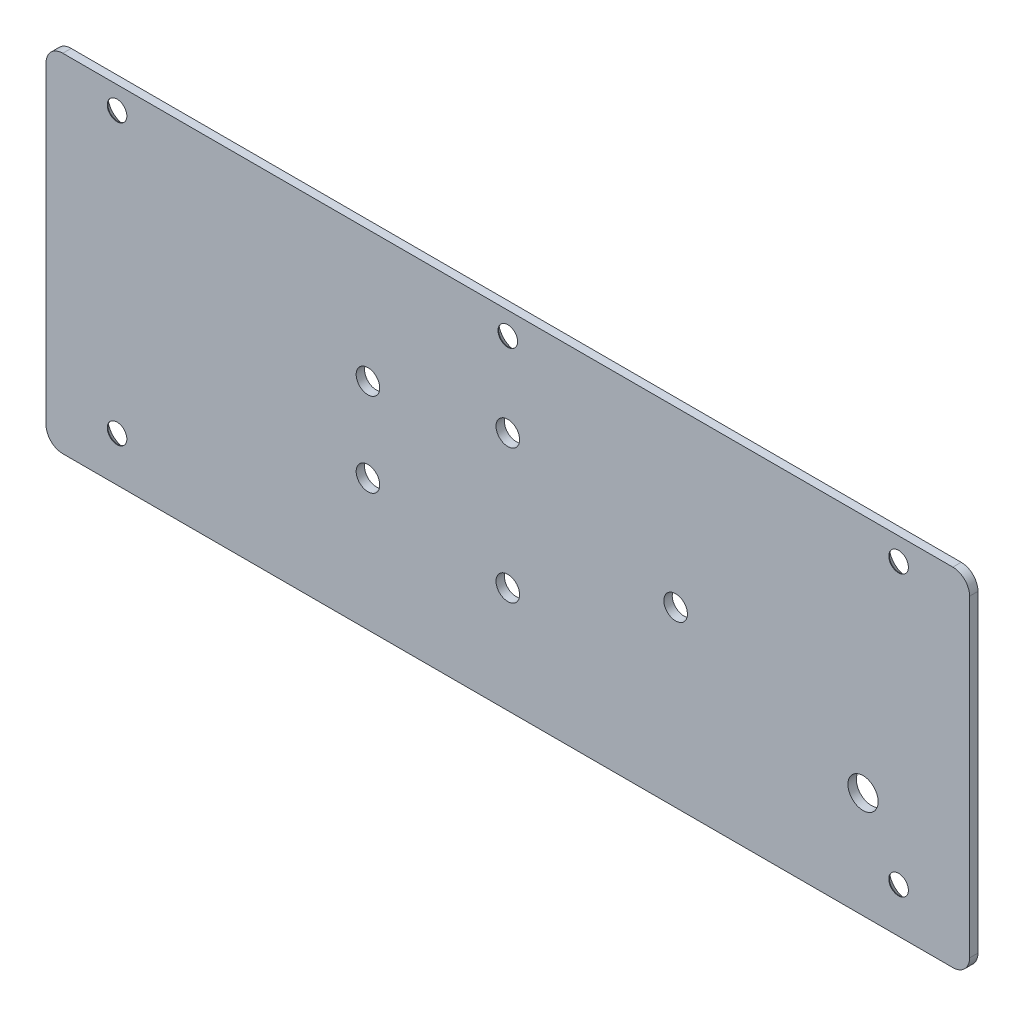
ISO-10303-21;
HEADER;
FILE_DESCRIPTION(('STEP AP214'),'2;1');
FILE_NAME('part.step','',(''),(''),'','','');
FILE_SCHEMA(('AUTOMOTIVE_DESIGN { 1 0 10303 214 1 1 1 1 }'));
ENDSEC;
DATA;
#1=APPLICATION_CONTEXT('core data for automotive mechanical design processes');
#2=APPLICATION_PROTOCOL_DEFINITION('international standard','automotive_design',2000,#1);
#3=PRODUCT_CONTEXT('',#1,'mechanical');
#4=PRODUCT('Part','Part','',(#3));
#5=PRODUCT_RELATED_PRODUCT_CATEGORY('part','',(#4));
#6=PRODUCT_DEFINITION_FORMATION('','',#4);
#7=PRODUCT_DEFINITION_CONTEXT('part definition',#1,'design');
#8=PRODUCT_DEFINITION('design','',#6,#7);
#9=PRODUCT_DEFINITION_SHAPE('','',#8);
#10=(LENGTH_UNIT() NAMED_UNIT(*) SI_UNIT(.MILLI.,.METRE.));
#11=(NAMED_UNIT(*) PLANE_ANGLE_UNIT() SI_UNIT($,.RADIAN.));
#12=(NAMED_UNIT(*) SI_UNIT($,.STERADIAN.) SOLID_ANGLE_UNIT());
#13=UNCERTAINTY_MEASURE_WITH_UNIT(LENGTH_MEASURE(1.E-05),#10,'distance_accuracy_value','');
#14=(GEOMETRIC_REPRESENTATION_CONTEXT(3) GLOBAL_UNCERTAINTY_ASSIGNED_CONTEXT((#13)) GLOBAL_UNIT_ASSIGNED_CONTEXT((#10,
#11,#12)) REPRESENTATION_CONTEXT('',''));
#15=CARTESIAN_POINT('',(0.,0.,0.));
#16=DIRECTION('',(0.,0.,1.));
#17=DIRECTION('',(1.,0.,0.));
#18=AXIS2_PLACEMENT_3D('',#15,#16,#17);
#19=CARTESIAN_POINT('',(-165.1,0.,0.));
#20=DIRECTION('',(0.,0.,-1.));
#21=DIRECTION('',(0.,1.,0.));
#22=AXIS2_PLACEMENT_3D('',#19,#20,#21);
#23=PLANE('',#22);
#24=CARTESIAN_POINT('',(-82.55,58.,0.));
#25=DIRECTION('',(0.,0.,-1.));
#26=DIRECTION('',(0.,1.,0.));
#27=AXIS2_PLACEMENT_3D('',#24,#25,#26);
#28=CIRCLE('',#27,3.15000000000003);
#29=CARTESIAN_POINT('',(-85.7,58.,0.));
#30=VERTEX_POINT('',#29);
#31=EDGE_CURVE('E248',#30,#30,#28,.F.);
#32=ORIENTED_EDGE('',*,*,#31,.T.);
#33=EDGE_LOOP('',(#32));
#34=FACE_BOUND('',#33,.T.);
#35=CARTESIAN_POINT('',(-152.4,58.,0.));
#36=DIRECTION('',(0.,0.,-1.));
#37=DIRECTION('',(0.,1.,0.));
#38=AXIS2_PLACEMENT_3D('',#35,#36,#37);
#39=CIRCLE('',#38,3.14999999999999);
#40=CARTESIAN_POINT('',(-152.4,61.15,0.));
#41=VERTEX_POINT('',#40);
#42=EDGE_CURVE('E244',#41,#41,#39,.F.);
#43=ORIENTED_EDGE('',*,*,#42,.T.);
#44=EDGE_LOOP('',(#43));
#45=FACE_BOUND('',#44,.T.);
#46=CARTESIAN_POINT('',(-152.4,8.,0.));
#47=DIRECTION('',(0.,0.,-1.));
#48=DIRECTION('',(0.,1.,0.));
#49=AXIS2_PLACEMENT_3D('',#46,#47,#48);
#50=CIRCLE('',#49,3.14999999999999);
#51=CARTESIAN_POINT('',(-152.4,11.15,0.));
#52=VERTEX_POINT('',#51);
#53=EDGE_CURVE('E240',#52,#52,#50,.F.);
#54=ORIENTED_EDGE('',*,*,#53,.T.);
#55=EDGE_LOOP('',(#54));
#56=FACE_BOUND('',#55,.T.);
#57=CARTESIAN_POINT('',(-12.7,8.,0.));
#58=DIRECTION('',(0.,0.,-1.));
#59=DIRECTION('',(0.,1.,0.));
#60=AXIS2_PLACEMENT_3D('',#57,#58,#59);
#61=CIRCLE('',#60,3.15000000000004);
#62=CARTESIAN_POINT('',(-12.7,11.15,0.));
#63=VERTEX_POINT('',#62);
#64=EDGE_CURVE('E236',#63,#63,#61,.F.);
#65=ORIENTED_EDGE('',*,*,#64,.T.);
#66=EDGE_LOOP('',(#65));
#67=FACE_BOUND('',#66,.T.);
#68=CARTESIAN_POINT('',(-12.7,58.,0.));
#69=DIRECTION('',(0.,0.,-1.));
#70=DIRECTION('',(0.,1.,0.));
#71=AXIS2_PLACEMENT_3D('',#68,#69,#70);
#72=CIRCLE('',#71,3.15);
#73=CARTESIAN_POINT('',(-12.7,61.15,0.));
#74=VERTEX_POINT('',#73);
#75=EDGE_CURVE('E232',#74,#74,#72,.F.);
#76=ORIENTED_EDGE('',*,*,#75,.T.);
#77=EDGE_LOOP('',(#76));
#78=FACE_BOUND('',#77,.T.);
#79=DIRECTION('',(0.,1.,0.));
#80=VECTOR('',#79,1.);
#81=CARTESIAN_POINT('',(-165.1,0.,0.));
#82=LINE('',#81,#80);
#83=CARTESIAN_POINT('',(-165.1,3.,0.));
#84=VERTEX_POINT('',#83);
#85=CARTESIAN_POINT('',(-165.1,59.,0.));
#86=VERTEX_POINT('',#85);
#87=EDGE_CURVE('E133',#84,#86,#82,.T.);
#88=ORIENTED_EDGE('',*,*,#87,.T.);
#89=CARTESIAN_POINT('',(-162.1,59.,0.));
#90=DIRECTION('',(0.,0.,-1.));
#91=DIRECTION('',(0.,1.,0.));
#92=AXIS2_PLACEMENT_3D('',#89,#90,#91);
#93=CIRCLE('',#92,3.);
#94=CARTESIAN_POINT('',(-162.1,62.,0.));
#95=VERTEX_POINT('',#94);
#96=EDGE_CURVE('E140',#86,#95,#93,.T.);
#97=ORIENTED_EDGE('',*,*,#96,.T.);
#98=DIRECTION('',(1.,0.,0.));
#99=VECTOR('',#98,1.);
#100=CARTESIAN_POINT('',(-165.1,62.,0.));
#101=LINE('',#100,#99);
#102=CARTESIAN_POINT('',(-3.,62.,0.));
#103=VERTEX_POINT('',#102);
#104=EDGE_CURVE('E219',#95,#103,#101,.T.);
#105=ORIENTED_EDGE('',*,*,#104,.T.);
#106=CARTESIAN_POINT('',(-3.,59.,0.));
#107=DIRECTION('',(0.,0.,-1.));
#108=DIRECTION('',(0.,1.,0.));
#109=AXIS2_PLACEMENT_3D('',#106,#107,#108);
#110=CIRCLE('',#109,3.);
#111=CARTESIAN_POINT('',(0.,59.,0.));
#112=VERTEX_POINT('',#111);
#113=EDGE_CURVE('E162',#103,#112,#110,.T.);
#114=ORIENTED_EDGE('',*,*,#113,.T.);
#115=DIRECTION('',(0.,1.,0.));
#116=VECTOR('',#115,1.);
#117=CARTESIAN_POINT('',(0.,0.,0.));
#118=LINE('',#117,#116);
#119=CARTESIAN_POINT('',(0.,3.,0.));
#120=VERTEX_POINT('',#119);
#121=EDGE_CURVE('E206',#120,#112,#118,.T.);
#122=ORIENTED_EDGE('',*,*,#121,.F.);
#123=CARTESIAN_POINT('',(-3.,3.,0.));
#124=DIRECTION('',(0.,0.,-1.));
#125=DIRECTION('',(0.,1.,0.));
#126=AXIS2_PLACEMENT_3D('',#123,#124,#125);
#127=CIRCLE('',#126,3.);
#128=CARTESIAN_POINT('',(-3.,0.,0.));
#129=VERTEX_POINT('',#128);
#130=EDGE_CURVE('E141',#120,#129,#127,.T.);
#131=ORIENTED_EDGE('',*,*,#130,.T.);
#132=DIRECTION('',(1.,0.,0.));
#133=VECTOR('',#132,1.);
#134=CARTESIAN_POINT('',(-165.1,0.,0.));
#135=LINE('',#134,#133);
#136=CARTESIAN_POINT('',(-162.1,0.,0.));
#137=VERTEX_POINT('',#136);
#138=EDGE_CURVE('E135',#137,#129,#135,.T.);
#139=ORIENTED_EDGE('',*,*,#138,.F.);
#140=CARTESIAN_POINT('',(-162.1,3.,0.));
#141=DIRECTION('',(0.,0.,-1.));
#142=DIRECTION('',(0.,1.,0.));
#143=AXIS2_PLACEMENT_3D('',#140,#141,#142);
#144=CIRCLE('',#143,3.);
#145=EDGE_CURVE('E130',#137,#84,#144,.T.);
#146=ORIENTED_EDGE('',*,*,#145,.T.);
#147=EDGE_LOOP('',(#88,#97,#105,#114,#122,#131,#139,#146));
#148=FACE_BOUND('',#147,.T.);
#149=CARTESIAN_POINT('',(-107.55,38.5,0.));
#150=DIRECTION('',(0.,0.,-1.));
#151=DIRECTION('',(0.,1.,0.));
#152=AXIS2_PLACEMENT_3D('',#149,#150,#151);
#153=CIRCLE('',#152,2.1082);
#154=CARTESIAN_POINT('',(-107.55,40.6082,0.));
#155=VERTEX_POINT('',#154);
#156=EDGE_CURVE('E318',#155,#155,#153,.T.);
#157=ORIENTED_EDGE('',*,*,#156,.F.);
#158=EDGE_LOOP('',(#157));
#159=FACE_BOUND('',#158,.T.);
#160=CARTESIAN_POINT('',(-52.55,31.,0.));
#161=DIRECTION('',(0.,0.,-1.));
#162=DIRECTION('',(0.,1.,0.));
#163=AXIS2_PLACEMENT_3D('',#160,#161,#162);
#164=CIRCLE('',#163,2.1082);
#165=CARTESIAN_POINT('',(-52.55,33.1082,0.));
#166=VERTEX_POINT('',#165);
#167=EDGE_CURVE('E346',#166,#166,#164,.T.);
#168=ORIENTED_EDGE('',*,*,#167,.F.);
#169=EDGE_LOOP('',(#168));
#170=FACE_BOUND('',#169,.T.);
#171=CARTESIAN_POINT('',(-82.55,19.,0.));
#172=DIRECTION('',(0.,0.,-1.));
#173=DIRECTION('',(0.,1.,0.));
#174=AXIS2_PLACEMENT_3D('',#171,#172,#173);
#175=CIRCLE('',#174,2.1082);
#176=CARTESIAN_POINT('',(-82.55,21.1082,0.));
#177=VERTEX_POINT('',#176);
#178=EDGE_CURVE('E331',#177,#177,#175,.T.);
#179=ORIENTED_EDGE('',*,*,#178,.F.);
#180=EDGE_LOOP('',(#179));
#181=FACE_BOUND('',#180,.T.);
#182=CARTESIAN_POINT('',(-107.55,23.5,0.));
#183=DIRECTION('',(0.,0.,-1.));
#184=DIRECTION('',(0.,1.,0.));
#185=AXIS2_PLACEMENT_3D('',#182,#183,#184);
#186=CIRCLE('',#185,2.1082);
#187=CARTESIAN_POINT('',(-107.55,25.6082,0.));
#188=VERTEX_POINT('',#187);
#189=EDGE_CURVE('E330',#188,#188,#186,.T.);
#190=ORIENTED_EDGE('',*,*,#189,.F.);
#191=EDGE_LOOP('',(#190));
#192=FACE_BOUND('',#191,.T.);
#193=CARTESIAN_POINT('',(-82.55,43.,0.));
#194=DIRECTION('',(0.,0.,-1.));
#195=DIRECTION('',(0.,1.,0.));
#196=AXIS2_PLACEMENT_3D('',#193,#194,#195);
#197=CIRCLE('',#196,2.1082);
#198=CARTESIAN_POINT('',(-82.55,45.1082,0.));
#199=VERTEX_POINT('',#198);
#200=EDGE_CURVE('E322',#199,#199,#197,.T.);
#201=ORIENTED_EDGE('',*,*,#200,.F.);
#202=EDGE_LOOP('',(#201));
#203=FACE_BOUND('',#202,.T.);
#204=CARTESIAN_POINT('',(-19.05,19.,0.));
#205=DIRECTION('',(0.,0.,-1.));
#206=DIRECTION('',(0.,1.,0.));
#207=AXIS2_PLACEMENT_3D('',#204,#205,#206);
#208=CIRCLE('',#207,5.);
#209=CARTESIAN_POINT('',(-19.05,14.,0.));
#210=VERTEX_POINT('',#209);
#211=EDGE_CURVE('E382',#210,#210,#208,.T.);
#212=ORIENTED_EDGE('',*,*,#211,.F.);
#213=EDGE_LOOP('',(#212));
#214=FACE_BOUND('',#213,.T.);
#215=ADVANCED_FACE('F62',(#34,#45,#56,#67,#78,#148,#159,#170,#181,#192,#203,#214),#23,.T.);
#216=CARTESIAN_POINT('',(-165.1,0.,0.));
#217=DIRECTION('',(0.,1.,0.));
#218=DIRECTION('',(0.,0.,1.));
#219=AXIS2_PLACEMENT_3D('',#216,#217,#218);
#220=PLANE('',#219);
#221=DIRECTION('',(1.,0.,0.));
#222=VECTOR('',#221,1.);
#223=CARTESIAN_POINT('',(-165.1,0.,1.5));
#224=LINE('',#223,#222);
#225=CARTESIAN_POINT('',(-162.1,0.,1.5));
#226=VERTEX_POINT('',#225);
#227=CARTESIAN_POINT('',(-3.,0.,1.5));
#228=VERTEX_POINT('',#227);
#229=EDGE_CURVE('E227',#226,#228,#224,.T.);
#230=ORIENTED_EDGE('',*,*,#229,.F.);
#231=DIRECTION('',(0.,0.,1.));
#232=VECTOR('',#231,1.);
#233=CARTESIAN_POINT('',(-162.1,0.,0.));
#234=LINE('',#233,#232);
#235=EDGE_CURVE('E195',#226,#137,#234,.F.);
#236=ORIENTED_EDGE('',*,*,#235,.T.);
#237=ORIENTED_EDGE('',*,*,#138,.T.);
#238=DIRECTION('',(0.,0.,1.));
#239=VECTOR('',#238,1.);
#240=CARTESIAN_POINT('',(-3.,0.,0.));
#241=LINE('',#240,#239);
#242=EDGE_CURVE('E192',#129,#228,#241,.T.);
#243=ORIENTED_EDGE('',*,*,#242,.T.);
#244=EDGE_LOOP('',(#230,#236,#237,#243));
#245=FACE_BOUND('',#244,.T.);
#246=ADVANCED_FACE('F281',(#245),#220,.F.);
#247=CARTESIAN_POINT('',(-165.1,0.,1.5));
#248=DIRECTION('',(0.,0.,-1.));
#249=DIRECTION('',(0.,1.,0.));
#250=AXIS2_PLACEMENT_3D('',#247,#248,#249);
#251=PLANE('',#250);
#252=CARTESIAN_POINT('',(-19.05,19.,1.5));
#253=DIRECTION('',(0.,0.,-1.));
#254=DIRECTION('',(0.,1.,0.));
#255=AXIS2_PLACEMENT_3D('',#252,#253,#254);
#256=CIRCLE('',#255,2.7);
#257=CARTESIAN_POINT('',(-19.05,21.7,1.5));
#258=VERTEX_POINT('',#257);
#259=EDGE_CURVE('E367',#258,#258,#256,.F.);
#260=ORIENTED_EDGE('',*,*,#259,.F.);
#261=EDGE_LOOP('',(#260));
#262=FACE_BOUND('',#261,.T.);
#263=CARTESIAN_POINT('',(-152.4,8.,1.5));
#264=DIRECTION('',(0.,0.,1.));
#265=DIRECTION('',(1.,0.,0.));
#266=AXIS2_PLACEMENT_3D('',#263,#264,#265);
#267=CIRCLE('',#266,1.75000000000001);
#268=CARTESIAN_POINT('',(-150.65,8.,1.5));
#269=VERTEX_POINT('',#268);
#270=EDGE_CURVE('E362',#269,#269,#267,.T.);
#271=ORIENTED_EDGE('',*,*,#270,.F.);
#272=EDGE_LOOP('',(#271));
#273=FACE_BOUND('',#272,.T.);
#274=CARTESIAN_POINT('',(-12.7,8.,1.5));
#275=DIRECTION('',(0.,0.,1.));
#276=DIRECTION('',(1.,0.,0.));
#277=AXIS2_PLACEMENT_3D('',#274,#275,#276);
#278=CIRCLE('',#277,1.75);
#279=CARTESIAN_POINT('',(-10.95,8.,1.5));
#280=VERTEX_POINT('',#279);
#281=EDGE_CURVE('E366',#280,#280,#278,.T.);
#282=ORIENTED_EDGE('',*,*,#281,.F.);
#283=EDGE_LOOP('',(#282));
#284=FACE_BOUND('',#283,.T.);
#285=CARTESIAN_POINT('',(-12.7,58.,1.5));
#286=DIRECTION('',(0.,0.,1.));
#287=DIRECTION('',(1.,0.,0.));
#288=AXIS2_PLACEMENT_3D('',#285,#286,#287);
#289=CIRCLE('',#288,1.75);
#290=CARTESIAN_POINT('',(-10.95,58.,1.5));
#291=VERTEX_POINT('',#290);
#292=EDGE_CURVE('E371',#291,#291,#289,.T.);
#293=ORIENTED_EDGE('',*,*,#292,.F.);
#294=EDGE_LOOP('',(#293));
#295=FACE_BOUND('',#294,.T.);
#296=CARTESIAN_POINT('',(-152.4,58.,1.5));
#297=DIRECTION('',(0.,0.,1.));
#298=DIRECTION('',(1.,0.,0.));
#299=AXIS2_PLACEMENT_3D('',#296,#297,#298);
#300=CIRCLE('',#299,1.75000000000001);
#301=CARTESIAN_POINT('',(-150.65,58.,1.5));
#302=VERTEX_POINT('',#301);
#303=EDGE_CURVE('E361',#302,#302,#300,.T.);
#304=ORIENTED_EDGE('',*,*,#303,.F.);
#305=EDGE_LOOP('',(#304));
#306=FACE_BOUND('',#305,.T.);
#307=CARTESIAN_POINT('',(-82.55,58.,1.5));
#308=DIRECTION('',(0.,0.,1.));
#309=DIRECTION('',(1.,0.,0.));
#310=AXIS2_PLACEMENT_3D('',#307,#308,#309);
#311=CIRCLE('',#310,1.75);
#312=CARTESIAN_POINT('',(-80.8,58.,1.5));
#313=VERTEX_POINT('',#312);
#314=EDGE_CURVE('E347',#313,#313,#311,.T.);
#315=ORIENTED_EDGE('',*,*,#314,.F.);
#316=EDGE_LOOP('',(#315));
#317=FACE_BOUND('',#316,.T.);
#318=CARTESIAN_POINT('',(-82.55,43.,1.5));
#319=DIRECTION('',(0.,0.,-1.));
#320=DIRECTION('',(0.,1.,0.));
#321=AXIS2_PLACEMENT_3D('',#318,#319,#320);
#322=CIRCLE('',#321,2.1082);
#323=CARTESIAN_POINT('',(-82.55,45.1082,1.5));
#324=VERTEX_POINT('',#323);
#325=EDGE_CURVE('E335',#324,#324,#322,.T.);
#326=ORIENTED_EDGE('',*,*,#325,.T.);
#327=EDGE_LOOP('',(#326));
#328=FACE_BOUND('',#327,.T.);
#329=CARTESIAN_POINT('',(-107.55,23.5,1.5));
#330=DIRECTION('',(0.,0.,-1.));
#331=DIRECTION('',(0.,1.,0.));
#332=AXIS2_PLACEMENT_3D('',#329,#330,#331);
#333=CIRCLE('',#332,2.1082);
#334=CARTESIAN_POINT('',(-107.55,25.6082,1.5));
#335=VERTEX_POINT('',#334);
#336=EDGE_CURVE('E326',#335,#335,#333,.T.);
#337=ORIENTED_EDGE('',*,*,#336,.T.);
#338=EDGE_LOOP('',(#337));
#339=FACE_BOUND('',#338,.T.);
#340=CARTESIAN_POINT('',(-82.55,19.,1.5));
#341=DIRECTION('',(0.,0.,-1.));
#342=DIRECTION('',(0.,1.,0.));
#343=AXIS2_PLACEMENT_3D('',#340,#341,#342);
#344=CIRCLE('',#343,2.1082);
#345=CARTESIAN_POINT('',(-82.55,21.1082,1.5));
#346=VERTEX_POINT('',#345);
#347=EDGE_CURVE('E351',#346,#346,#344,.T.);
#348=ORIENTED_EDGE('',*,*,#347,.T.);
#349=EDGE_LOOP('',(#348));
#350=FACE_BOUND('',#349,.T.);
#351=CARTESIAN_POINT('',(-52.55,31.,1.5));
#352=DIRECTION('',(0.,0.,-1.));
#353=DIRECTION('',(0.,1.,0.));
#354=AXIS2_PLACEMENT_3D('',#351,#352,#353);
#355=CIRCLE('',#354,2.1082);
#356=CARTESIAN_POINT('',(-52.55,33.1082,1.5));
#357=VERTEX_POINT('',#356);
#358=EDGE_CURVE('E342',#357,#357,#355,.T.);
#359=ORIENTED_EDGE('',*,*,#358,.T.);
#360=EDGE_LOOP('',(#359));
#361=FACE_BOUND('',#360,.T.);
#362=CARTESIAN_POINT('',(-107.55,38.5,1.5));
#363=DIRECTION('',(0.,0.,-1.));
#364=DIRECTION('',(0.,1.,0.));
#365=AXIS2_PLACEMENT_3D('',#362,#363,#364);
#366=CIRCLE('',#365,2.1082);
#367=CARTESIAN_POINT('',(-107.55,40.6082,1.5));
#368=VERTEX_POINT('',#367);
#369=EDGE_CURVE('E316',#368,#368,#366,.T.);
#370=ORIENTED_EDGE('',*,*,#369,.T.);
#371=EDGE_LOOP('',(#370));
#372=FACE_BOUND('',#371,.T.);
#373=DIRECTION('',(1.,0.,0.));
#374=VECTOR('',#373,1.);
#375=CARTESIAN_POINT('',(-165.1,62.,1.5));
#376=LINE('',#375,#374);
#377=CARTESIAN_POINT('',(-162.1,62.,1.5));
#378=VERTEX_POINT('',#377);
#379=CARTESIAN_POINT('',(-3.,62.,1.5));
#380=VERTEX_POINT('',#379);
#381=EDGE_CURVE('E221',#378,#380,#376,.T.);
#382=ORIENTED_EDGE('',*,*,#381,.F.);
#383=CARTESIAN_POINT('',(-162.1,59.,1.5));
#384=DIRECTION('',(0.,0.,-1.));
#385=DIRECTION('',(0.,1.,0.));
#386=AXIS2_PLACEMENT_3D('',#383,#384,#385);
#387=CIRCLE('',#386,3.);
#388=CARTESIAN_POINT('',(-165.1,59.,1.5));
#389=VERTEX_POINT('',#388);
#390=EDGE_CURVE('E189',#378,#389,#387,.F.);
#391=ORIENTED_EDGE('',*,*,#390,.T.);
#392=DIRECTION('',(0.,1.,0.));
#393=VECTOR('',#392,1.);
#394=CARTESIAN_POINT('',(-165.1,0.,1.5));
#395=LINE('',#394,#393);
#396=CARTESIAN_POINT('',(-165.1,3.,1.5));
#397=VERTEX_POINT('',#396);
#398=EDGE_CURVE('E152',#397,#389,#395,.T.);
#399=ORIENTED_EDGE('',*,*,#398,.F.);
#400=CARTESIAN_POINT('',(-162.1,3.,1.5));
#401=DIRECTION('',(0.,0.,-1.));
#402=DIRECTION('',(0.,1.,0.));
#403=AXIS2_PLACEMENT_3D('',#400,#401,#402);
#404=CIRCLE('',#403,3.);
#405=EDGE_CURVE('E86',#397,#226,#404,.F.);
#406=ORIENTED_EDGE('',*,*,#405,.T.);
#407=ORIENTED_EDGE('',*,*,#229,.T.);
#408=CARTESIAN_POINT('',(-3.,3.,1.5));
#409=DIRECTION('',(0.,0.,-1.));
#410=DIRECTION('',(0.,1.,0.));
#411=AXIS2_PLACEMENT_3D('',#408,#409,#410);
#412=CIRCLE('',#411,3.);
#413=CARTESIAN_POINT('',(0.,3.,1.5));
#414=VERTEX_POINT('',#413);
#415=EDGE_CURVE('E78',#228,#414,#412,.F.);
#416=ORIENTED_EDGE('',*,*,#415,.T.);
#417=DIRECTION('',(0.,1.,0.));
#418=VECTOR('',#417,1.);
#419=CARTESIAN_POINT('',(0.,0.,1.5));
#420=LINE('',#419,#418);
#421=CARTESIAN_POINT('',(0.,59.,1.5));
#422=VERTEX_POINT('',#421);
#423=EDGE_CURVE('E153',#414,#422,#420,.T.);
#424=ORIENTED_EDGE('',*,*,#423,.T.);
#425=CARTESIAN_POINT('',(-3.,59.,1.5));
#426=DIRECTION('',(0.,0.,-1.));
#427=DIRECTION('',(0.,1.,0.));
#428=AXIS2_PLACEMENT_3D('',#425,#426,#427);
#429=CIRCLE('',#428,3.);
#430=EDGE_CURVE('E182',#422,#380,#429,.F.);
#431=ORIENTED_EDGE('',*,*,#430,.T.);
#432=EDGE_LOOP('',(#382,#391,#399,#406,#407,#416,#424,#431));
#433=FACE_BOUND('',#432,.T.);
#434=ADVANCED_FACE('F210',(#262,#273,#284,#295,#306,#317,#328,#339,#350,#361,#372,#433),#251,.F.);
#435=CARTESIAN_POINT('',(-165.1,62.,1.5));
#436=DIRECTION('',(0.,-1.,0.));
#437=DIRECTION('',(0.,0.,-1.));
#438=AXIS2_PLACEMENT_3D('',#435,#436,#437);
#439=PLANE('',#438);
#440=ORIENTED_EDGE('',*,*,#104,.F.);
#441=DIRECTION('',(0.,0.,-1.));
#442=VECTOR('',#441,1.);
#443=CARTESIAN_POINT('',(-162.1,62.,1.5));
#444=LINE('',#443,#442);
#445=EDGE_CURVE('E179',#95,#378,#444,.F.);
#446=ORIENTED_EDGE('',*,*,#445,.T.);
#447=ORIENTED_EDGE('',*,*,#381,.T.);
#448=DIRECTION('',(0.,0.,-1.));
#449=VECTOR('',#448,1.);
#450=CARTESIAN_POINT('',(-3.,62.,1.5));
#451=LINE('',#450,#449);
#452=EDGE_CURVE('E175',#380,#103,#451,.T.);
#453=ORIENTED_EDGE('',*,*,#452,.T.);
#454=EDGE_LOOP('',(#440,#446,#447,#453));
#455=FACE_BOUND('',#454,.T.);
#456=ADVANCED_FACE('F218',(#455),#439,.F.);
#457=CARTESIAN_POINT('',(-165.1,0.,0.));
#458=DIRECTION('',(-1.,0.,0.));
#459=DIRECTION('',(0.,0.,1.));
#460=AXIS2_PLACEMENT_3D('',#457,#458,#459);
#461=PLANE('',#460);
#462=ORIENTED_EDGE('',*,*,#398,.T.);
#463=DIRECTION('',(0.,0.,-1.));
#464=VECTOR('',#463,1.);
#465=CARTESIAN_POINT('',(-165.1,59.,0.));
#466=LINE('',#465,#464);
#467=EDGE_CURVE('E150',#389,#86,#466,.T.);
#468=ORIENTED_EDGE('',*,*,#467,.T.);
#469=ORIENTED_EDGE('',*,*,#87,.F.);
#470=DIRECTION('',(0.,0.,1.));
#471=VECTOR('',#470,1.);
#472=CARTESIAN_POINT('',(-165.1,3.,1.5));
#473=LINE('',#472,#471);
#474=EDGE_CURVE('E148',#84,#397,#473,.T.);
#475=ORIENTED_EDGE('',*,*,#474,.T.);
#476=EDGE_LOOP('',(#462,#468,#469,#475));
#477=FACE_BOUND('',#476,.T.);
#478=ADVANCED_FACE('F147',(#477),#461,.T.);
#479=CARTESIAN_POINT('',(0.,0.,0.));
#480=DIRECTION('',(-1.,0.,0.));
#481=DIRECTION('',(0.,0.,1.));
#482=AXIS2_PLACEMENT_3D('',#479,#480,#481);
#483=PLANE('',#482);
#484=ORIENTED_EDGE('',*,*,#423,.F.);
#485=DIRECTION('',(0.,0.,1.));
#486=VECTOR('',#485,1.);
#487=CARTESIAN_POINT('',(0.,3.,0.));
#488=LINE('',#487,#486);
#489=EDGE_CURVE('E13',#414,#120,#488,.F.);
#490=ORIENTED_EDGE('',*,*,#489,.T.);
#491=ORIENTED_EDGE('',*,*,#121,.T.);
#492=DIRECTION('',(0.,0.,-1.));
#493=VECTOR('',#492,1.);
#494=CARTESIAN_POINT('',(0.,59.,0.));
#495=LINE('',#494,#493);
#496=EDGE_CURVE('E71',#112,#422,#495,.F.);
#497=ORIENTED_EDGE('',*,*,#496,.T.);
#498=EDGE_LOOP('',(#484,#490,#491,#497));
#499=FACE_BOUND('',#498,.T.);
#500=ADVANCED_FACE('F204',(#499),#483,.F.);
#501=CARTESIAN_POINT('',(-107.55,38.5,1.5));
#502=DIRECTION('',(0.,0.,-1.));
#503=DIRECTION('',(0.,1.,0.));
#504=AXIS2_PLACEMENT_3D('',#501,#502,#503);
#505=CYLINDRICAL_SURFACE('',#504,2.1082);
#506=ORIENTED_EDGE('',*,*,#369,.F.);
#507=EDGE_LOOP('',(#506));
#508=FACE_BOUND('',#507,.T.);
#509=ORIENTED_EDGE('',*,*,#156,.T.);
#510=EDGE_LOOP('',(#509));
#511=FACE_BOUND('',#510,.T.);
#512=ADVANCED_FACE('F439',(#508,#511),#505,.F.);
#513=CARTESIAN_POINT('',(-52.55,31.,1.5));
#514=DIRECTION('',(0.,0.,-1.));
#515=DIRECTION('',(0.,1.,0.));
#516=AXIS2_PLACEMENT_3D('',#513,#514,#515);
#517=CYLINDRICAL_SURFACE('',#516,2.1082);
#518=ORIENTED_EDGE('',*,*,#358,.F.);
#519=EDGE_LOOP('',(#518));
#520=FACE_BOUND('',#519,.T.);
#521=ORIENTED_EDGE('',*,*,#167,.T.);
#522=EDGE_LOOP('',(#521));
#523=FACE_BOUND('',#522,.T.);
#524=ADVANCED_FACE('F435',(#520,#523),#517,.F.);
#525=CARTESIAN_POINT('',(-82.55,19.,1.5));
#526=DIRECTION('',(0.,0.,-1.));
#527=DIRECTION('',(0.,1.,0.));
#528=AXIS2_PLACEMENT_3D('',#525,#526,#527);
#529=CYLINDRICAL_SURFACE('',#528,2.1082);
#530=ORIENTED_EDGE('',*,*,#347,.F.);
#531=EDGE_LOOP('',(#530));
#532=FACE_BOUND('',#531,.T.);
#533=ORIENTED_EDGE('',*,*,#178,.T.);
#534=EDGE_LOOP('',(#533));
#535=FACE_BOUND('',#534,.T.);
#536=ADVANCED_FACE('F431',(#532,#535),#529,.F.);
#537=CARTESIAN_POINT('',(-107.55,23.5,1.5));
#538=DIRECTION('',(0.,0.,-1.));
#539=DIRECTION('',(0.,1.,0.));
#540=AXIS2_PLACEMENT_3D('',#537,#538,#539);
#541=CYLINDRICAL_SURFACE('',#540,2.1082);
#542=ORIENTED_EDGE('',*,*,#336,.F.);
#543=EDGE_LOOP('',(#542));
#544=FACE_BOUND('',#543,.T.);
#545=ORIENTED_EDGE('',*,*,#189,.T.);
#546=EDGE_LOOP('',(#545));
#547=FACE_BOUND('',#546,.T.);
#548=ADVANCED_FACE('F434',(#544,#547),#541,.F.);
#549=CARTESIAN_POINT('',(-82.55,43.,1.5));
#550=DIRECTION('',(0.,0.,-1.));
#551=DIRECTION('',(0.,1.,0.));
#552=AXIS2_PLACEMENT_3D('',#549,#550,#551);
#553=CYLINDRICAL_SURFACE('',#552,2.1082);
#554=ORIENTED_EDGE('',*,*,#325,.F.);
#555=EDGE_LOOP('',(#554));
#556=FACE_BOUND('',#555,.T.);
#557=ORIENTED_EDGE('',*,*,#200,.T.);
#558=EDGE_LOOP('',(#557));
#559=FACE_BOUND('',#558,.T.);
#560=ADVANCED_FACE('F429',(#556,#559),#553,.F.);
#561=CARTESIAN_POINT('',(-82.55,58.,0.));
#562=DIRECTION('',(0.,0.,1.));
#563=DIRECTION('',(1.,0.,0.));
#564=AXIS2_PLACEMENT_3D('',#561,#562,#563);
#565=CYLINDRICAL_SURFACE('',#564,1.75);
#566=CARTESIAN_POINT('',(-82.55,58.,1.40000000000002));
#567=DIRECTION('',(0.,0.,-1.));
#568=DIRECTION('',(-1.,0.,0.));
#569=AXIS2_PLACEMENT_3D('',#566,#567,#568);
#570=CIRCLE('',#569,1.75);
#571=CARTESIAN_POINT('',(-84.3,58.,1.40000000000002));
#572=VERTEX_POINT('',#571);
#573=EDGE_CURVE('E252',#572,#572,#570,.T.);
#574=ORIENTED_EDGE('',*,*,#573,.T.);
#575=EDGE_LOOP('',(#574));
#576=FACE_BOUND('',#575,.T.);
#577=ORIENTED_EDGE('',*,*,#314,.T.);
#578=EDGE_LOOP('',(#577));
#579=FACE_BOUND('',#578,.T.);
#580=ADVANCED_FACE('F417',(#576,#579),#565,.F.);
#581=CARTESIAN_POINT('',(-152.4,58.,0.));
#582=DIRECTION('',(0.,0.,1.));
#583=DIRECTION('',(1.,0.,0.));
#584=AXIS2_PLACEMENT_3D('',#581,#582,#583);
#585=CYLINDRICAL_SURFACE('',#584,1.75000000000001);
#586=CARTESIAN_POINT('',(-152.4,58.,1.4));
#587=DIRECTION('',(0.,0.,-1.));
#588=DIRECTION('',(-1.,0.,0.));
#589=AXIS2_PLACEMENT_3D('',#586,#587,#588);
#590=CIRCLE('',#589,1.75000000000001);
#591=CARTESIAN_POINT('',(-154.15,58.,1.4));
#592=VERTEX_POINT('',#591);
#593=EDGE_CURVE('E256',#592,#592,#590,.T.);
#594=ORIENTED_EDGE('',*,*,#593,.T.);
#595=EDGE_LOOP('',(#594));
#596=FACE_BOUND('',#595,.T.);
#597=ORIENTED_EDGE('',*,*,#303,.T.);
#598=EDGE_LOOP('',(#597));
#599=FACE_BOUND('',#598,.T.);
#600=ADVANCED_FACE('F413',(#596,#599),#585,.F.);
#601=CARTESIAN_POINT('',(-12.7,58.,0.));
#602=DIRECTION('',(0.,0.,1.));
#603=DIRECTION('',(1.,0.,0.));
#604=AXIS2_PLACEMENT_3D('',#601,#602,#603);
#605=CYLINDRICAL_SURFACE('',#604,1.75);
#606=CARTESIAN_POINT('',(-12.7,58.,1.40000000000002));
#607=DIRECTION('',(0.,0.,-1.));
#608=DIRECTION('',(-1.,0.,0.));
#609=AXIS2_PLACEMENT_3D('',#606,#607,#608);
#610=CIRCLE('',#609,1.75);
#611=CARTESIAN_POINT('',(-14.45,58.,1.40000000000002));
#612=VERTEX_POINT('',#611);
#613=EDGE_CURVE('E157',#612,#612,#610,.T.);
#614=ORIENTED_EDGE('',*,*,#613,.T.);
#615=EDGE_LOOP('',(#614));
#616=FACE_BOUND('',#615,.T.);
#617=ORIENTED_EDGE('',*,*,#292,.T.);
#618=EDGE_LOOP('',(#617));
#619=FACE_BOUND('',#618,.T.);
#620=ADVANCED_FACE('F416',(#616,#619),#605,.F.);
#621=CARTESIAN_POINT('',(-12.7,8.,0.));
#622=DIRECTION('',(0.,0.,1.));
#623=DIRECTION('',(1.,0.,0.));
#624=AXIS2_PLACEMENT_3D('',#621,#622,#623);
#625=CYLINDRICAL_SURFACE('',#624,1.75);
#626=CARTESIAN_POINT('',(-12.7,8.,1.40000000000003));
#627=DIRECTION('',(0.,0.,-1.));
#628=DIRECTION('',(-1.,0.,0.));
#629=AXIS2_PLACEMENT_3D('',#626,#627,#628);
#630=CIRCLE('',#629,1.75);
#631=CARTESIAN_POINT('',(-14.45,8.,1.40000000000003));
#632=VERTEX_POINT('',#631);
#633=EDGE_CURVE('E165',#632,#632,#630,.T.);
#634=ORIENTED_EDGE('',*,*,#633,.T.);
#635=EDGE_LOOP('',(#634));
#636=FACE_BOUND('',#635,.T.);
#637=ORIENTED_EDGE('',*,*,#281,.T.);
#638=EDGE_LOOP('',(#637));
#639=FACE_BOUND('',#638,.T.);
#640=ADVANCED_FACE('F268',(#636,#639),#625,.F.);
#641=CARTESIAN_POINT('',(-152.4,8.,0.));
#642=DIRECTION('',(0.,0.,1.));
#643=DIRECTION('',(1.,0.,0.));
#644=AXIS2_PLACEMENT_3D('',#641,#642,#643);
#645=CYLINDRICAL_SURFACE('',#644,1.75000000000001);
#646=CARTESIAN_POINT('',(-152.4,8.,1.4));
#647=DIRECTION('',(0.,0.,-1.));
#648=DIRECTION('',(-1.,0.,0.));
#649=AXIS2_PLACEMENT_3D('',#646,#647,#648);
#650=CIRCLE('',#649,1.75000000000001);
#651=CARTESIAN_POINT('',(-154.15,8.,1.4));
#652=VERTEX_POINT('',#651);
#653=EDGE_CURVE('E260',#652,#652,#650,.T.);
#654=ORIENTED_EDGE('',*,*,#653,.T.);
#655=EDGE_LOOP('',(#654));
#656=FACE_BOUND('',#655,.T.);
#657=ORIENTED_EDGE('',*,*,#270,.T.);
#658=EDGE_LOOP('',(#657));
#659=FACE_BOUND('',#658,.T.);
#660=ADVANCED_FACE('F409',(#656,#659),#645,.F.);
#661=CARTESIAN_POINT('',(-19.05,19.,1.501));
#662=DIRECTION('',(0.,0.,-1.));
#663=DIRECTION('',(0.,1.,0.));
#664=AXIS2_PLACEMENT_3D('',#661,#662,#663);
#665=CYLINDRICAL_SURFACE('',#664,2.7);
#666=ORIENTED_EDGE('',*,*,#259,.T.);
#667=EDGE_LOOP('',(#666));
#668=FACE_BOUND('',#667,.T.);
#669=CARTESIAN_POINT('',(-19.05,19.,-0.00999999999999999));
#670=DIRECTION('',(0.,0.,-1.));
#671=DIRECTION('',(0.,1.,0.));
#672=AXIS2_PLACEMENT_3D('',#669,#670,#671);
#673=CIRCLE('',#672,2.7);
#674=CARTESIAN_POINT('',(-19.05,21.7,-0.00999999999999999));
#675=VERTEX_POINT('',#674);
#676=EDGE_CURVE('E386',#675,#675,#673,.T.);
#677=ORIENTED_EDGE('',*,*,#676,.T.);
#678=EDGE_LOOP('',(#677));
#679=FACE_BOUND('',#678,.T.);
#680=ADVANCED_FACE('F395',(#668,#679),#665,.F.);
#681=CARTESIAN_POINT('',(-19.05,19.,-0.00999999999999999));
#682=DIRECTION('',(0.,0.,-1.));
#683=DIRECTION('',(0.,1.,0.));
#684=AXIS2_PLACEMENT_3D('',#681,#682,#683);
#685=PLANE('',#684);
#686=CARTESIAN_POINT('',(-19.05,19.,-0.00999999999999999));
#687=DIRECTION('',(0.,0.,-1.));
#688=DIRECTION('',(0.,1.,0.));
#689=AXIS2_PLACEMENT_3D('',#686,#687,#688);
#690=CIRCLE('',#689,5.);
#691=CARTESIAN_POINT('',(-19.05,14.,-0.00999999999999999));
#692=VERTEX_POINT('',#691);
#693=EDGE_CURVE('E381',#692,#692,#690,.T.);
#694=ORIENTED_EDGE('',*,*,#693,.T.);
#695=EDGE_LOOP('',(#694));
#696=FACE_BOUND('',#695,.T.);
#697=ORIENTED_EDGE('',*,*,#676,.F.);
#698=EDGE_LOOP('',(#697));
#699=FACE_BOUND('',#698,.T.);
#700=ADVANCED_FACE('F397',(#696,#699),#685,.T.);
#701=CARTESIAN_POINT('',(-19.05,19.,-0.00999999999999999));
#702=DIRECTION('',(0.,0.,1.));
#703=DIRECTION('',(0.,-1.,0.));
#704=AXIS2_PLACEMENT_3D('',#701,#702,#703);
#705=CYLINDRICAL_SURFACE('',#704,5.);
#706=CARTESIAN_POINT('',(-19.05,14.,-0.00999999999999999));
#707=CARTESIAN_POINT('',(-19.05,14.,-0.00989583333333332));
#708=CARTESIAN_POINT('',(-19.05,14.,-0.00979166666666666));
#709=CARTESIAN_POINT('',(-19.05,14.,-0.00958333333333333));
#710=CARTESIAN_POINT('',(-19.05,14.,-0.00947916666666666));
#711=CARTESIAN_POINT('',(-19.05,14.,-0.00927083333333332));
#712=CARTESIAN_POINT('',(-19.05,14.,-0.00916666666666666));
#713=CARTESIAN_POINT('',(-19.05,14.,-0.00895833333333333));
#714=CARTESIAN_POINT('',(-19.05,14.,-0.00885416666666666));
#715=CARTESIAN_POINT('',(-19.05,14.,-0.00864583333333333));
#716=CARTESIAN_POINT('',(-19.05,14.,-0.00854166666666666));
#717=CARTESIAN_POINT('',(-19.05,14.,-0.00833333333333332));
#718=CARTESIAN_POINT('',(-19.05,14.,-0.00822916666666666));
#719=CARTESIAN_POINT('',(-19.05,14.,-0.00802083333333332));
#720=CARTESIAN_POINT('',(-19.05,14.,-0.00791666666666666));
#721=CARTESIAN_POINT('',(-19.05,14.,-0.00770833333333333));
#722=CARTESIAN_POINT('',(-19.05,14.,-0.00760416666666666));
#723=CARTESIAN_POINT('',(-19.05,14.,-0.00739583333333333));
#724=CARTESIAN_POINT('',(-19.05,14.,-0.00729166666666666));
#725=CARTESIAN_POINT('',(-19.05,14.,-0.00708333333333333));
#726=CARTESIAN_POINT('',(-19.05,14.,-0.00697916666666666));
#727=CARTESIAN_POINT('',(-19.05,14.,-0.00677083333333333));
#728=CARTESIAN_POINT('',(-19.05,14.,-0.00666666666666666));
#729=CARTESIAN_POINT('',(-19.05,14.,-0.00645833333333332));
#730=CARTESIAN_POINT('',(-19.05,14.,-0.00635416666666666));
#731=CARTESIAN_POINT('',(-19.05,14.,-0.00614583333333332));
#732=CARTESIAN_POINT('',(-19.05,14.,-0.00604166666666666));
#733=CARTESIAN_POINT('',(-19.05,14.,-0.00583333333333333));
#734=CARTESIAN_POINT('',(-19.05,14.,-0.00572916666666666));
#735=CARTESIAN_POINT('',(-19.05,14.,-0.00552083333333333));
#736=CARTESIAN_POINT('',(-19.05,14.,-0.00541666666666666));
#737=CARTESIAN_POINT('',(-19.05,14.,-0.00520833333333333));
#738=CARTESIAN_POINT('',(-19.05,14.,-0.00510416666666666));
#739=CARTESIAN_POINT('',(-19.05,14.,-0.00489583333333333));
#740=CARTESIAN_POINT('',(-19.05,14.,-0.00479166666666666));
#741=CARTESIAN_POINT('',(-19.05,14.,-0.00458333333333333));
#742=CARTESIAN_POINT('',(-19.05,14.,-0.00447916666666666));
#743=CARTESIAN_POINT('',(-19.05,14.,-0.00427083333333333));
#744=CARTESIAN_POINT('',(-19.05,14.,-0.00416666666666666));
#745=CARTESIAN_POINT('',(-19.05,14.,-0.00395833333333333));
#746=CARTESIAN_POINT('',(-19.05,14.,-0.00385416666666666));
#747=CARTESIAN_POINT('',(-19.05,14.,-0.00364583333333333));
#748=CARTESIAN_POINT('',(-19.05,14.,-0.00354166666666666));
#749=CARTESIAN_POINT('',(-19.05,14.,-0.00333333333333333));
#750=CARTESIAN_POINT('',(-19.05,14.,-0.00322916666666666));
#751=CARTESIAN_POINT('',(-19.05,14.,-0.00302083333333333));
#752=CARTESIAN_POINT('',(-19.05,14.,-0.00291666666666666));
#753=CARTESIAN_POINT('',(-19.05,14.,-0.00270833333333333));
#754=CARTESIAN_POINT('',(-19.05,14.,-0.00260416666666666));
#755=CARTESIAN_POINT('',(-19.05,14.,-0.00239583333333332));
#756=CARTESIAN_POINT('',(-19.05,14.,-0.00229166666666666));
#757=CARTESIAN_POINT('',(-19.05,14.,-0.00208333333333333));
#758=CARTESIAN_POINT('',(-19.05,14.,-0.00197916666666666));
#759=CARTESIAN_POINT('',(-19.05,14.,-0.00177083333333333));
#760=CARTESIAN_POINT('',(-19.05,14.,-0.00166666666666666));
#761=CARTESIAN_POINT('',(-19.05,14.,-0.00145833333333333));
#762=CARTESIAN_POINT('',(-19.05,14.,-0.00135416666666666));
#763=CARTESIAN_POINT('',(-19.05,14.,-0.00114583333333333));
#764=CARTESIAN_POINT('',(-19.05,14.,-0.00104166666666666));
#765=CARTESIAN_POINT('',(-19.05,14.,-0.000833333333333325));
#766=CARTESIAN_POINT('',(-19.05,14.,-0.000729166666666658));
#767=CARTESIAN_POINT('',(-19.05,14.,-0.000520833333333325));
#768=CARTESIAN_POINT('',(-19.05,14.,-0.000416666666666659));
#769=CARTESIAN_POINT('',(-19.05,14.,-0.000208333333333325));
#770=CARTESIAN_POINT('',(-19.05,14.,-0.000104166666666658));
#771=CARTESIAN_POINT('',(-19.05,14.,0.));
#772=B_SPLINE_CURVE_WITH_KNOTS('',3,(#706,#707,#708,#709,#710,#711,#712,#713,#714,#715,#716,
#717,#718,#719,#720,#721,#722,#723,#724,#725,#726,#727,#728,#729,#730,#731,#732,#733,#734,#735,
#736,#737,#738,#739,#740,#741,#742,#743,#744,#745,#746,#747,#748,#749,#750,#751,#752,#753,#754,
#755,#756,#757,#758,#759,#760,#761,#762,#763,#764,#765,#766,#767,#768,#769,#770,#771),
.UNSPECIFIED.,.F.,.F.,(4,2,2,2,2,2,2,2,2,2,2,2,2,2,2,2,2,2,2,2,2,2,2,2,2,2,2,2,2,2,2,2,4),(0.,
0.000312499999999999,0.000625,0.000937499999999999,0.00125,0.0015625,0.001875,0.0021875,0.0025,
0.0028125,0.003125,0.0034375,0.00375,0.0040625,0.004375,0.0046875,0.005,0.0053125,0.005625,
0.0059375,0.00625,0.0065625,0.006875,0.0071875,0.0075,0.0078125,0.008125,0.0084375,0.00875,
0.0090625,0.009375,0.0096875,0.01),.UNSPECIFIED.);
#773=EDGE_CURVE('BSEAM399',#692,#210,#772,.T.);
#774=ORIENTED_EDGE('',*,*,#693,.F.);
#775=ORIENTED_EDGE('',*,*,#211,.T.);
#776=ORIENTED_EDGE('',*,*,#773,.T.);
#777=ORIENTED_EDGE('',*,*,#773,.F.);
#778=EDGE_LOOP('',(#774,#776,#775,#777));
#779=FACE_BOUND('',#778,.T.);
#780=ADVANCED_FACE('F399',(#779),#705,.T.);
#781=CARTESIAN_POINT('',(-82.55,58.,0.));
#782=DIRECTION('',(0.,0.,-1.));
#783=DIRECTION('',(-1.,0.,0.));
#784=AXIS2_PLACEMENT_3D('',#781,#782,#783);
#785=CONICAL_SURFACE('',#784,3.15000000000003,0.785398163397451);
#786=CARTESIAN_POINT('',(-84.3,58.,1.40000000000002));
#787=CARTESIAN_POINT('',(-84.3145833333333,58.,1.38541666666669));
#788=CARTESIAN_POINT('',(-84.3291666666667,58.,1.37083333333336));
#789=CARTESIAN_POINT('',(-84.3583333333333,58.,1.34166666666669));
#790=CARTESIAN_POINT('',(-84.3729166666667,58.,1.32708333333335));
#791=CARTESIAN_POINT('',(-84.4020833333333,58.,1.29791666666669));
#792=CARTESIAN_POINT('',(-84.4166666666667,58.,1.28333333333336));
#793=CARTESIAN_POINT('',(-84.4458333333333,58.,1.25416666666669));
#794=CARTESIAN_POINT('',(-84.4604166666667,58.,1.23958333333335));
#795=CARTESIAN_POINT('',(-84.4895833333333,58.,1.21041666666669));
#796=CARTESIAN_POINT('',(-84.5041666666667,58.,1.19583333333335));
#797=CARTESIAN_POINT('',(-84.5333333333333,58.,1.16666666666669));
#798=CARTESIAN_POINT('',(-84.5479166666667,58.,1.15208333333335));
#799=CARTESIAN_POINT('',(-84.5770833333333,58.,1.12291666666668));
#800=CARTESIAN_POINT('',(-84.5916666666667,58.,1.10833333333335));
#801=CARTESIAN_POINT('',(-84.6208333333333,58.,1.07916666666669));
#802=CARTESIAN_POINT('',(-84.6354166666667,58.,1.06458333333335));
#803=CARTESIAN_POINT('',(-84.6645833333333,58.,1.03541666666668));
#804=CARTESIAN_POINT('',(-84.6791666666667,58.,1.02083333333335));
#805=CARTESIAN_POINT('',(-84.7083333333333,58.,0.991666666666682));
#806=CARTESIAN_POINT('',(-84.7229166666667,58.,0.977083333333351));
#807=CARTESIAN_POINT('',(-84.7520833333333,58.,0.947916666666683));
#808=CARTESIAN_POINT('',(-84.7666666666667,58.,0.933333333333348));
#809=CARTESIAN_POINT('',(-84.7958333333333,58.,0.90416666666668));
#810=CARTESIAN_POINT('',(-84.8104166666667,58.,0.889583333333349));
#811=CARTESIAN_POINT('',(-84.8395833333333,58.,0.860416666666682));
#812=CARTESIAN_POINT('',(-84.8541666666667,58.,0.845833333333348));
#813=CARTESIAN_POINT('',(-84.8833333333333,58.,0.816666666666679));
#814=CARTESIAN_POINT('',(-84.8979166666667,58.,0.802083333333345));
#815=CARTESIAN_POINT('',(-84.9270833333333,58.,0.772916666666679));
#816=CARTESIAN_POINT('',(-84.9416666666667,58.,0.758333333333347));
#817=CARTESIAN_POINT('',(-84.9708333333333,58.,0.72916666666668));
#818=CARTESIAN_POINT('',(-84.9854166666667,58.,0.714583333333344));
#819=CARTESIAN_POINT('',(-85.0145833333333,58.,0.685416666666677));
#820=CARTESIAN_POINT('',(-85.0291666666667,58.,0.670833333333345));
#821=CARTESIAN_POINT('',(-85.0583333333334,58.,0.641666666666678));
#822=CARTESIAN_POINT('',(-85.0729166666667,58.,0.627083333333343));
#823=CARTESIAN_POINT('',(-85.1020833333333,58.,0.597916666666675));
#824=CARTESIAN_POINT('',(-85.1166666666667,58.,0.583333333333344));
#825=CARTESIAN_POINT('',(-85.1458333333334,58.,0.554166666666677));
#826=CARTESIAN_POINT('',(-85.1604166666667,58.,0.539583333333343));
#827=CARTESIAN_POINT('',(-85.1895833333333,58.,0.510416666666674));
#828=CARTESIAN_POINT('',(-85.2041666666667,58.,0.49583333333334));
#829=CARTESIAN_POINT('',(-85.2333333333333,58.,0.466666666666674));
#830=CARTESIAN_POINT('',(-85.2479166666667,58.,0.452083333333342));
#831=CARTESIAN_POINT('',(-85.2770833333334,58.,0.422916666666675));
#832=CARTESIAN_POINT('',(-85.2916666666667,58.,0.408333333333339));
#833=CARTESIAN_POINT('',(-85.3208333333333,58.,0.379166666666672));
#834=CARTESIAN_POINT('',(-85.3354166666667,58.,0.36458333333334));
#835=CARTESIAN_POINT('',(-85.3645833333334,58.,0.335416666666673));
#836=CARTESIAN_POINT('',(-85.3791666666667,58.,0.320833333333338));
#837=CARTESIAN_POINT('',(-85.4083333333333,58.,0.29166666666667));
#838=CARTESIAN_POINT('',(-85.4229166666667,58.,0.277083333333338));
#839=CARTESIAN_POINT('',(-85.4520833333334,58.,0.247916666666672));
#840=CARTESIAN_POINT('',(-85.4666666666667,58.,0.233333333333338));
#841=CARTESIAN_POINT('',(-85.4958333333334,58.,0.204166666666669));
#842=CARTESIAN_POINT('',(-85.5104166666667,58.,0.189583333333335));
#843=CARTESIAN_POINT('',(-85.5395833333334,58.,0.160416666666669));
#844=CARTESIAN_POINT('',(-85.5541666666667,58.,0.145833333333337));
#845=CARTESIAN_POINT('',(-85.5833333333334,58.,0.11666666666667));
#846=CARTESIAN_POINT('',(-85.5979166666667,58.,0.102083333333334));
#847=CARTESIAN_POINT('',(-85.6270833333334,58.,0.0729166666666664));
#848=CARTESIAN_POINT('',(-85.6416666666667,58.,0.0583333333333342));
#849=CARTESIAN_POINT('',(-85.6708333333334,58.,0.0291666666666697));
#850=CARTESIAN_POINT('',(-85.6854166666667,58.,0.0145833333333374));
#851=CARTESIAN_POINT('',(-85.7,58.,0.));
#852=B_SPLINE_CURVE_WITH_KNOTS('',3,(#786,#787,#788,#789,#790,#791,#792,#793,#794,#795,#796,
#797,#798,#799,#800,#801,#802,#803,#804,#805,#806,#807,#808,#809,#810,#811,#812,#813,#814,#815,
#816,#817,#818,#819,#820,#821,#822,#823,#824,#825,#826,#827,#828,#829,#830,#831,#832,#833,#834,
#835,#836,#837,#838,#839,#840,#841,#842,#843,#844,#845,#846,#847,#848,#849,#850,#851),
.UNSPECIFIED.,.F.,.F.,(4,2,2,2,2,2,2,2,2,2,2,2,2,2,2,2,2,2,2,2,2,2,2,2,2,2,2,2,2,2,2,2,4),(0.,
0.0618718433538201,0.12374368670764,0.18561553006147,0.24748737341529,0.30935921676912,
0.37123106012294,0.433102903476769,0.494974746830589,0.55684659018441,0.618718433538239,
0.680590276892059,0.742462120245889,0.804333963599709,0.866205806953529,0.928077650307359,
0.989949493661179,1.05182133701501,1.11369318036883,1.17556502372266,1.23743686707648,
1.2993087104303,1.36118055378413,1.42305239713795,1.48492424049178,1.5467960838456,
1.60866792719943,1.67053977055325,1.73241161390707,1.7942834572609,1.85615530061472,
1.91802714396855,1.97989898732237),.UNSPECIFIED.);
#853=EDGE_CURVE('BSEAM405',#572,#30,#852,.T.);
#854=ORIENTED_EDGE('',*,*,#573,.F.);
#855=ORIENTED_EDGE('',*,*,#31,.F.);
#856=ORIENTED_EDGE('',*,*,#853,.T.);
#857=ORIENTED_EDGE('',*,*,#853,.F.);
#858=EDGE_LOOP('',(#854,#856,#855,#857));
#859=FACE_BOUND('',#858,.T.);
#860=ADVANCED_FACE('F405',(#859),#785,.F.);
#861=CARTESIAN_POINT('',(-152.4,58.,0.));
#862=DIRECTION('',(0.,0.,-1.));
#863=DIRECTION('',(-1.,0.,0.));
#864=AXIS2_PLACEMENT_3D('',#861,#862,#863);
#865=CONICAL_SURFACE('',#864,3.14999999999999,0.785398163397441);
#866=ORIENTED_EDGE('',*,*,#593,.F.);
#867=EDGE_LOOP('',(#866));
#868=FACE_BOUND('',#867,.T.);
#869=ORIENTED_EDGE('',*,*,#42,.F.);
#870=EDGE_LOOP('',(#869));
#871=FACE_BOUND('',#870,.T.);
#872=ADVANCED_FACE('F467',(#868,#871),#865,.F.);
#873=CARTESIAN_POINT('',(-152.4,8.,0.));
#874=DIRECTION('',(0.,0.,-1.));
#875=DIRECTION('',(-1.,0.,0.));
#876=AXIS2_PLACEMENT_3D('',#873,#874,#875);
#877=CONICAL_SURFACE('',#876,3.14999999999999,0.785398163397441);
#878=ORIENTED_EDGE('',*,*,#653,.F.);
#879=EDGE_LOOP('',(#878));
#880=FACE_BOUND('',#879,.T.);
#881=ORIENTED_EDGE('',*,*,#53,.F.);
#882=EDGE_LOOP('',(#881));
#883=FACE_BOUND('',#882,.T.);
#884=ADVANCED_FACE('F275',(#880,#883),#877,.F.);
#885=CARTESIAN_POINT('',(-12.7,8.,0.));
#886=DIRECTION('',(0.,0.,-1.));
#887=DIRECTION('',(-1.,0.,0.));
#888=AXIS2_PLACEMENT_3D('',#885,#886,#887);
#889=CONICAL_SURFACE('',#888,3.15000000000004,0.785398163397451);
#890=ORIENTED_EDGE('',*,*,#633,.F.);
#891=EDGE_LOOP('',(#890));
#892=FACE_BOUND('',#891,.T.);
#893=ORIENTED_EDGE('',*,*,#64,.F.);
#894=EDGE_LOOP('',(#893));
#895=FACE_BOUND('',#894,.T.);
#896=ADVANCED_FACE('F271',(#892,#895),#889,.F.);
#897=CARTESIAN_POINT('',(-12.7,58.,0.));
#898=DIRECTION('',(0.,0.,-1.));
#899=DIRECTION('',(-1.,0.,0.));
#900=AXIS2_PLACEMENT_3D('',#897,#898,#899);
#901=CONICAL_SURFACE('',#900,3.15,0.785398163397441);
#902=ORIENTED_EDGE('',*,*,#613,.F.);
#903=EDGE_LOOP('',(#902));
#904=FACE_BOUND('',#903,.T.);
#905=ORIENTED_EDGE('',*,*,#75,.F.);
#906=EDGE_LOOP('',(#905));
#907=FACE_BOUND('',#906,.T.);
#908=ADVANCED_FACE('F274',(#904,#907),#901,.F.);
#909=CARTESIAN_POINT('',(-162.1,59.,0.));
#910=DIRECTION('',(0.,0.,1.));
#911=DIRECTION('',(1.,0.,0.));
#912=AXIS2_PLACEMENT_3D('',#909,#910,#911);
#913=CYLINDRICAL_SURFACE('',#912,3.);
#914=ORIENTED_EDGE('',*,*,#390,.F.);
#915=ORIENTED_EDGE('',*,*,#445,.F.);
#916=ORIENTED_EDGE('',*,*,#96,.F.);
#917=ORIENTED_EDGE('',*,*,#467,.F.);
#918=EDGE_LOOP('',(#914,#915,#916,#917));
#919=FACE_BOUND('',#918,.T.);
#920=ADVANCED_FACE('F287',(#919),#913,.T.);
#921=CARTESIAN_POINT('',(-162.1,3.,0.));
#922=DIRECTION('',(0.,0.,-1.));
#923=DIRECTION('',(0.,1.,0.));
#924=AXIS2_PLACEMENT_3D('',#921,#922,#923);
#925=CYLINDRICAL_SURFACE('',#924,3.);
#926=ORIENTED_EDGE('',*,*,#145,.F.);
#927=ORIENTED_EDGE('',*,*,#235,.F.);
#928=ORIENTED_EDGE('',*,*,#405,.F.);
#929=ORIENTED_EDGE('',*,*,#474,.F.);
#930=EDGE_LOOP('',(#926,#927,#928,#929));
#931=FACE_BOUND('',#930,.T.);
#932=ADVANCED_FACE('F155',(#931),#925,.T.);
#933=CARTESIAN_POINT('',(-3.,3.,0.));
#934=DIRECTION('',(0.,0.,1.));
#935=DIRECTION('',(0.,-1.,0.));
#936=AXIS2_PLACEMENT_3D('',#933,#934,#935);
#937=CYLINDRICAL_SURFACE('',#936,3.);
#938=ORIENTED_EDGE('',*,*,#130,.F.);
#939=ORIENTED_EDGE('',*,*,#489,.F.);
#940=ORIENTED_EDGE('',*,*,#415,.F.);
#941=ORIENTED_EDGE('',*,*,#242,.F.);
#942=EDGE_LOOP('',(#938,#939,#940,#941));
#943=FACE_BOUND('',#942,.T.);
#944=ADVANCED_FACE('F303',(#943),#937,.T.);
#945=CARTESIAN_POINT('',(-3.,59.,1.5));
#946=DIRECTION('',(0.,0.,-1.));
#947=DIRECTION('',(-1.,0.,0.));
#948=AXIS2_PLACEMENT_3D('',#945,#946,#947);
#949=CYLINDRICAL_SURFACE('',#948,3.);
#950=ORIENTED_EDGE('',*,*,#430,.F.);
#951=ORIENTED_EDGE('',*,*,#496,.F.);
#952=ORIENTED_EDGE('',*,*,#113,.F.);
#953=ORIENTED_EDGE('',*,*,#452,.F.);
#954=EDGE_LOOP('',(#950,#951,#952,#953));
#955=FACE_BOUND('',#954,.T.);
#956=ADVANCED_FACE('F64',(#955),#949,.T.);
#957=CLOSED_SHELL('',(#215,#246,#434,#456,#478,#500,#512,#524,#536,#548,#560,#580,#600,#620,
#640,#660,#680,#700,#780,#860,#872,#884,#896,#908,#920,#932,#944,#956));
#958=MANIFOLD_SOLID_BREP('B2',#957);
#959=ADVANCED_BREP_SHAPE_REPRESENTATION('',(#18,#958),#14);
#960=SHAPE_DEFINITION_REPRESENTATION(#9,#959);
ENDSEC;
END-ISO-10303-21;
